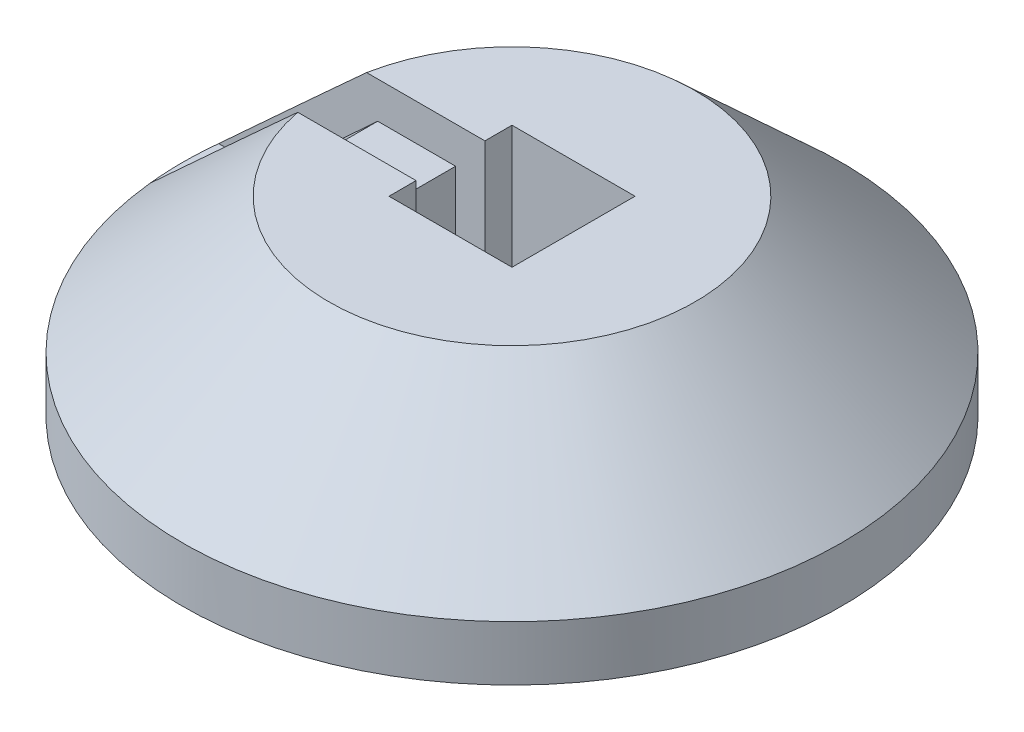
ISO-10303-21;
HEADER;
FILE_DESCRIPTION(('STEP AP214'),'2;1');
FILE_NAME('part.step','',(''),(''),'','','');
FILE_SCHEMA(('AUTOMOTIVE_DESIGN { 1 0 10303 214 1 1 1 1 }'));
ENDSEC;
DATA;
#1=APPLICATION_CONTEXT('core data for automotive mechanical design processes');
#2=APPLICATION_PROTOCOL_DEFINITION('international standard','automotive_design',2000,#1);
#3=PRODUCT_CONTEXT('',#1,'mechanical');
#4=PRODUCT('Part','Part','',(#3));
#5=PRODUCT_RELATED_PRODUCT_CATEGORY('part','',(#4));
#6=PRODUCT_DEFINITION_FORMATION('','',#4);
#7=PRODUCT_DEFINITION_CONTEXT('part definition',#1,'design');
#8=PRODUCT_DEFINITION('design','',#6,#7);
#9=PRODUCT_DEFINITION_SHAPE('','',#8);
#10=(LENGTH_UNIT() NAMED_UNIT(*) SI_UNIT(.MILLI.,.METRE.));
#11=(NAMED_UNIT(*) PLANE_ANGLE_UNIT() SI_UNIT($,.RADIAN.));
#12=(NAMED_UNIT(*) SI_UNIT($,.STERADIAN.) SOLID_ANGLE_UNIT());
#13=UNCERTAINTY_MEASURE_WITH_UNIT(LENGTH_MEASURE(1.E-05),#10,'distance_accuracy_value','');
#14=(GEOMETRIC_REPRESENTATION_CONTEXT(3) GLOBAL_UNCERTAINTY_ASSIGNED_CONTEXT((#13)) GLOBAL_UNIT_ASSIGNED_CONTEXT((#10,
#11,#12)) REPRESENTATION_CONTEXT('',''));
#15=CARTESIAN_POINT('',(0.,0.,0.));
#16=DIRECTION('',(0.,0.,1.));
#17=DIRECTION('',(1.,0.,0.));
#18=AXIS2_PLACEMENT_3D('',#15,#16,#17);
#19=CARTESIAN_POINT('',(0.,66.04,0.));
#20=DIRECTION('',(0.,-1.,0.));
#21=DIRECTION('',(1.,0.,0.));
#22=AXIS2_PLACEMENT_3D('',#19,#20,#21);
#23=CONICAL_SURFACE('',#22,63.5,0.824339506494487);
#24=CARTESIAN_POINT('',(0.,66.04,0.));
#25=DIRECTION('',(0.,1.,0.));
#26=DIRECTION('',(-1.,0.,0.));
#27=AXIS2_PLACEMENT_3D('',#24,#25,#26);
#28=CIRCLE('',#27,63.5);
#29=CARTESIAN_POINT('',(-62.367733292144,66.04,11.938));
#30=VERTEX_POINT('',#29);
#31=CARTESIAN_POINT('',(-62.367733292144,66.04,-11.938));
#32=VERTEX_POINT('',#31);
#33=EDGE_CURVE('E79',#30,#32,#28,.T.);
#34=ORIENTED_EDGE('',*,*,#33,.F.);
#35=CARTESIAN_POINT('',(0.000699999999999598,113.734849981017,11.938));
#36=CARTESIAN_POINT('',(-0.196541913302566,113.734884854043,11.938));
#37=CARTESIAN_POINT('',(-0.393775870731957,113.730350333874,11.938));
#38=CARTESIAN_POINT('',(-0.787801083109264,113.712322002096,11.938));
#39=CARTESIAN_POINT('',(-0.984592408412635,113.698829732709,11.938));
#40=CARTESIAN_POINT('',(-1.37695571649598,113.663103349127,11.938));
#41=CARTESIAN_POINT('',(-1.57252940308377,113.64088790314,11.938));
#42=CARTESIAN_POINT('',(-1.96253114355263,113.588052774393,11.938));
#43=CARTESIAN_POINT('',(-2.15695915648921,113.557432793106,11.938));
#44=CARTESIAN_POINT('',(-2.73003495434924,113.455010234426,11.938));
#45=CARTESIAN_POINT('',(-3.1066976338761,113.371859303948,11.938));
#46=CARTESIAN_POINT('',(-3.85310817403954,113.178662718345,11.938));
#47=CARTESIAN_POINT('',(-4.22285250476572,113.068603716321,11.938));
#48=CARTESIAN_POINT('',(-5.02037718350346,112.803923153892,11.938));
#49=CARTESIAN_POINT('',(-5.44667133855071,112.64484939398,11.938));
#50=CARTESIAN_POINT('',(-6.2889347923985,112.301189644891,11.938));
#51=CARTESIAN_POINT('',(-6.7048991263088,112.116591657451,11.938));
#52=CARTESIAN_POINT('',(-7.52786809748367,111.726818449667,11.938));
#53=CARTESIAN_POINT('',(-7.93485615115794,111.521608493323,11.938));
#54=CARTESIAN_POINT('',(-8.74016838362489,111.095081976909,11.938));
#55=CARTESIAN_POINT('',(-9.1384937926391,110.873767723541,11.938));
#56=CARTESIAN_POINT('',(-9.93540910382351,110.413784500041,11.938));
#57=CARTESIAN_POINT('',(-10.3338509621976,110.174860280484,11.938));
#58=CARTESIAN_POINT('',(-11.1240728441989,109.686258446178,11.938));
#59=CARTESIAN_POINT('',(-11.515852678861,109.436580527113,11.938));
#60=CARTESIAN_POINT('',(-12.2932869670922,108.92878963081,11.938));
#61=CARTESIAN_POINT('',(-12.6789476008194,108.670686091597,11.938));
#62=CARTESIAN_POINT('',(-13.2537711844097,108.278195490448,11.938));
#63=CARTESIAN_POINT('',(-13.4447654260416,108.146477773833,11.938));
#64=CARTESIAN_POINT('',(-13.8256238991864,107.881418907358,11.938));
#65=CARTESIAN_POINT('',(-14.0154881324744,107.74807776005,11.938));
#66=CARTESIAN_POINT('',(-14.6257731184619,107.315919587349,11.938));
#67=CARTESIAN_POINT('',(-15.0441378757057,107.014196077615,11.938));
#68=CARTESIAN_POINT('',(-15.8765077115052,106.404785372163,11.938));
#69=CARTESIAN_POINT('',(-16.2905126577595,106.097097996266,11.938));
#70=CARTESIAN_POINT('',(-17.1148437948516,105.476753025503,11.938));
#71=CARTESIAN_POINT('',(-17.5251696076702,105.164094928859,11.938));
#72=CARTESIAN_POINT('',(-18.3426387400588,104.534641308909,11.938));
#73=CARTESIAN_POINT('',(-18.7497820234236,104.217845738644,11.938));
#74=CARTESIAN_POINT('',(-19.5614915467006,103.580631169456,11.938));
#75=CARTESIAN_POINT('',(-19.9660566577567,103.260210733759,11.938));
#76=CARTESIAN_POINT('',(-20.7728076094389,102.616386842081,11.938));
#77=CARTESIAN_POINT('',(-21.1749934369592,102.292983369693,11.938));
#78=CARTESIAN_POINT('',(-22.378406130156,101.318990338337,11.938));
#79=CARTESIAN_POINT('',(-23.1765394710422,100.664577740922,11.938));
#80=CARTESIAN_POINT('',(-24.7676477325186,99.3471212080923,11.938));
#81=CARTESIAN_POINT('',(-25.5606131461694,98.6840658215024,11.938));
#82=CARTESIAN_POINT('',(-27.141552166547,97.352016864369,11.938));
#83=CARTESIAN_POINT('',(-27.9295257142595,96.6830232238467,11.938));
#84=CARTESIAN_POINT('',(-29.5012913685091,95.3405302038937,11.938));
#85=CARTESIAN_POINT('',(-30.2850844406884,94.6670319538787,11.938));
#86=CARTESIAN_POINT('',(-31.849435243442,93.3162971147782,11.938));
#87=CARTESIAN_POINT('',(-32.6299929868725,92.6390605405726,11.938));
#88=CARTESIAN_POINT('',(-34.180118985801,91.2888065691,11.938));
#89=CARTESIAN_POINT('',(-34.9497154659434,90.6158215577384,11.938));
#90=CARTESIAN_POINT('',(-36.4867461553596,89.2673861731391,11.938));
#91=CARTESIAN_POINT('',(-37.2541803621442,88.5919357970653,11.938));
#92=CARTESIAN_POINT('',(-39.5538627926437,86.5624375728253,11.938));
#93=CARTESIAN_POINT('',(-41.0834020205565,85.2053201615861,11.938));
#94=CARTESIAN_POINT('',(-44.1360317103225,82.4863161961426,11.938));
#95=CARTESIAN_POINT('',(-45.6591263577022,81.1244343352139,11.938));
#96=CARTESIAN_POINT('',(-48.7013737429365,78.3963315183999,11.938));
#97=CARTESIAN_POINT('',(-50.2205265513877,77.0301106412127,11.938));
#98=CARTESIAN_POINT('',(-53.0288597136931,74.4989054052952,11.938));
#99=CARTESIAN_POINT('',(-54.318455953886,73.3343822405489,11.938));
#100=CARTESIAN_POINT('',(-56.8958772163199,71.0033771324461,11.938));
#101=CARTESIAN_POINT('',(-58.1837022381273,69.8368951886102,11.938));
#102=CARTESIAN_POINT('',(-62.0450255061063,66.3350442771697,11.938));
#103=CARTESIAN_POINT('',(-64.616355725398,63.997284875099,11.938));
#104=CARTESIAN_POINT('',(-69.7557878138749,59.3166093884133,11.938));
#105=CARTESIAN_POINT('',(-72.3238884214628,56.9736919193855,11.938));
#106=CARTESIAN_POINT('',(-77.4571374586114,52.2846364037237,11.938));
#107=CARTESIAN_POINT('',(-80.0222858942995,49.9384983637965,11.938));
#108=CARTESIAN_POINT('',(-85.1808599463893,45.215899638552,11.938));
#109=CARTESIAN_POINT('',(-87.7742591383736,42.8394100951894,11.938));
#110=CARTESIAN_POINT('',(-92.9593226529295,38.0845356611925,11.938));
#111=CARTESIAN_POINT('',(-95.5509869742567,35.7061507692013,11.938));
#112=CARTESIAN_POINT('',(-100.732098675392,30.9486923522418,11.938));
#113=CARTESIAN_POINT('',(-103.321546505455,28.5696193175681,11.938));
#114=CARTESIAN_POINT('',(-108.499343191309,23.8102823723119,11.938));
#115=CARTESIAN_POINT('',(-111.087692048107,21.4300184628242,11.938));
#116=CARTESIAN_POINT('',(-113.67562250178,19.0493,11.938));
#117=B_SPLINE_CURVE_WITH_KNOTS('',3,(#35,#36,#37,#38,#39,#40,#41,#42,#43,#44,#45,#46,#47,#48,
#49,#50,#51,#52,#53,#54,#55,#56,#57,#58,#59,#60,#61,#62,#63,#64,#65,#66,#67,#68,#69,#70,#71,#72,
#73,#74,#75,#76,#77,#78,#79,#80,#81,#82,#83,#84,#85,#86,#87,#88,#89,#90,#91,#92,#93,#94,#95,#96,
#97,#98,#99,#100,#101,#102,#103,#104,#105,#106,#107,#108,#109,#110,#111,#112,#113,#114,#115,
#116),.UNSPECIFIED.,.F.,.F.,(4,2,2,2,2,2,2,2,2,2,2,2,2,2,2,2,2,2,2,2,2,2,2,2,2,2,2,2,2,2,2,2,2,
2,2,2,2,2,2,2,4),(0.,0.591659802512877,1.18321776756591,1.7735165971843,2.36383639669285,
3.51977225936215,4.67628265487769,6.04023799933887,7.40483669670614,8.77177492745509,
10.1385177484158,11.532067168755,12.9256560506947,14.3177341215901,15.0137555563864,
15.7097758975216,17.2571516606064,18.8045742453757,20.3521540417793,21.8997514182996,
23.44798534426,24.9962277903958,28.092516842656,31.1934394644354,34.2943986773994,
37.3946075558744,40.4948041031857,43.5618302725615,46.6288599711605,52.7632730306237,
58.8927702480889,65.0221569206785,70.2348846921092,75.4476137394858,85.873137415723,
96.301922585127,106.730686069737,117.283447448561,127.83621638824,138.385484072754,
148.934742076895),.UNSPECIFIED.);
#118=CARTESIAN_POINT('',(-113.674861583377,19.05,11.938));
#119=VERTEX_POINT('',#118);
#120=EDGE_CURVE('E197',#30,#119,#117,.T.);
#121=ORIENTED_EDGE('',*,*,#120,.T.);
#122=CARTESIAN_POINT('',(0.,19.05,0.));
#123=DIRECTION('',(0.,1.,0.));
#124=DIRECTION('',(-1.,0.,0.));
#125=AXIS2_PLACEMENT_3D('',#122,#123,#124);
#126=CIRCLE('',#125,114.3);
#127=CARTESIAN_POINT('',(-113.674861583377,19.05,-11.938));
#128=VERTEX_POINT('',#127);
#129=EDGE_CURVE('E215',#119,#128,#126,.T.);
#130=ORIENTED_EDGE('',*,*,#129,.T.);
#131=CARTESIAN_POINT('',(0.000699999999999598,113.734849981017,-11.938));
#132=CARTESIAN_POINT('',(-0.196541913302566,113.734884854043,-11.938));
#133=CARTESIAN_POINT('',(-0.393775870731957,113.730350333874,-11.938));
#134=CARTESIAN_POINT('',(-0.787801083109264,113.712322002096,-11.938));
#135=CARTESIAN_POINT('',(-0.984592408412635,113.698829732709,-11.938));
#136=CARTESIAN_POINT('',(-1.37695571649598,113.663103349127,-11.938));
#137=CARTESIAN_POINT('',(-1.57252940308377,113.64088790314,-11.938));
#138=CARTESIAN_POINT('',(-1.96253114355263,113.588052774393,-11.938));
#139=CARTESIAN_POINT('',(-2.15695915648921,113.557432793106,-11.938));
#140=CARTESIAN_POINT('',(-2.73003495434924,113.455010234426,-11.938));
#141=CARTESIAN_POINT('',(-3.1066976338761,113.371859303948,-11.938));
#142=CARTESIAN_POINT('',(-3.85310817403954,113.178662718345,-11.938));
#143=CARTESIAN_POINT('',(-4.22285250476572,113.068603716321,-11.938));
#144=CARTESIAN_POINT('',(-5.02037718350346,112.803923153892,-11.938));
#145=CARTESIAN_POINT('',(-5.44667133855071,112.64484939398,-11.938));
#146=CARTESIAN_POINT('',(-6.2889347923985,112.301189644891,-11.938));
#147=CARTESIAN_POINT('',(-6.7048991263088,112.116591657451,-11.938));
#148=CARTESIAN_POINT('',(-7.52786809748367,111.726818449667,-11.938));
#149=CARTESIAN_POINT('',(-7.93485615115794,111.521608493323,-11.938));
#150=CARTESIAN_POINT('',(-8.74016838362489,111.095081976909,-11.938));
#151=CARTESIAN_POINT('',(-9.1384937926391,110.873767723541,-11.938));
#152=CARTESIAN_POINT('',(-9.93540910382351,110.413784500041,-11.938));
#153=CARTESIAN_POINT('',(-10.3338509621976,110.174860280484,-11.938));
#154=CARTESIAN_POINT('',(-11.1240728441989,109.686258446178,-11.938));
#155=CARTESIAN_POINT('',(-11.515852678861,109.436580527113,-11.938));
#156=CARTESIAN_POINT('',(-12.2932869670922,108.92878963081,-11.938));
#157=CARTESIAN_POINT('',(-12.6789476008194,108.670686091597,-11.938));
#158=CARTESIAN_POINT('',(-13.2537711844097,108.278195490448,-11.938));
#159=CARTESIAN_POINT('',(-13.4447654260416,108.146477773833,-11.938));
#160=CARTESIAN_POINT('',(-13.8256238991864,107.881418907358,-11.938));
#161=CARTESIAN_POINT('',(-14.0154881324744,107.74807776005,-11.938));
#162=CARTESIAN_POINT('',(-14.6257731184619,107.315919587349,-11.938));
#163=CARTESIAN_POINT('',(-15.0441378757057,107.014196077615,-11.938));
#164=CARTESIAN_POINT('',(-15.8765077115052,106.404785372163,-11.938));
#165=CARTESIAN_POINT('',(-16.2905126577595,106.097097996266,-11.938));
#166=CARTESIAN_POINT('',(-17.1148437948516,105.476753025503,-11.938));
#167=CARTESIAN_POINT('',(-17.5251696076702,105.164094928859,-11.938));
#168=CARTESIAN_POINT('',(-18.3426387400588,104.534641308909,-11.938));
#169=CARTESIAN_POINT('',(-18.7497820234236,104.217845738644,-11.938));
#170=CARTESIAN_POINT('',(-19.5614915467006,103.580631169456,-11.938));
#171=CARTESIAN_POINT('',(-19.9660566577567,103.260210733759,-11.938));
#172=CARTESIAN_POINT('',(-20.7728076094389,102.616386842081,-11.938));
#173=CARTESIAN_POINT('',(-21.1749934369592,102.292983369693,-11.938));
#174=CARTESIAN_POINT('',(-22.378406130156,101.318990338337,-11.938));
#175=CARTESIAN_POINT('',(-23.1765394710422,100.664577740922,-11.938));
#176=CARTESIAN_POINT('',(-24.7676477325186,99.3471212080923,-11.938));
#177=CARTESIAN_POINT('',(-25.5606131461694,98.6840658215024,-11.938));
#178=CARTESIAN_POINT('',(-27.141552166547,97.352016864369,-11.938));
#179=CARTESIAN_POINT('',(-27.9295257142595,96.6830232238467,-11.938));
#180=CARTESIAN_POINT('',(-29.5012913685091,95.3405302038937,-11.938));
#181=CARTESIAN_POINT('',(-30.2850844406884,94.6670319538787,-11.938));
#182=CARTESIAN_POINT('',(-31.849435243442,93.3162971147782,-11.938));
#183=CARTESIAN_POINT('',(-32.6299929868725,92.6390605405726,-11.938));
#184=CARTESIAN_POINT('',(-34.180118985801,91.2888065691,-11.938));
#185=CARTESIAN_POINT('',(-34.9497154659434,90.6158215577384,-11.938));
#186=CARTESIAN_POINT('',(-36.4867461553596,89.2673861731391,-11.938));
#187=CARTESIAN_POINT('',(-37.2541803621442,88.5919357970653,-11.938));
#188=CARTESIAN_POINT('',(-39.5538627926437,86.5624375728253,-11.938));
#189=CARTESIAN_POINT('',(-41.0834020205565,85.2053201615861,-11.938));
#190=CARTESIAN_POINT('',(-44.1360317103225,82.4863161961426,-11.938));
#191=CARTESIAN_POINT('',(-45.6591263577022,81.1244343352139,-11.938));
#192=CARTESIAN_POINT('',(-48.7013737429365,78.3963315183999,-11.938));
#193=CARTESIAN_POINT('',(-50.2205265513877,77.0301106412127,-11.938));
#194=CARTESIAN_POINT('',(-53.0288597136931,74.4989054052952,-11.938));
#195=CARTESIAN_POINT('',(-54.318455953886,73.3343822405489,-11.938));
#196=CARTESIAN_POINT('',(-56.8958772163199,71.0033771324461,-11.938));
#197=CARTESIAN_POINT('',(-58.1837022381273,69.8368951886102,-11.938));
#198=CARTESIAN_POINT('',(-62.0450255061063,66.3350442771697,-11.938));
#199=CARTESIAN_POINT('',(-64.616355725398,63.997284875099,-11.938));
#200=CARTESIAN_POINT('',(-69.7557878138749,59.3166093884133,-11.938));
#201=CARTESIAN_POINT('',(-72.3238884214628,56.9736919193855,-11.938));
#202=CARTESIAN_POINT('',(-77.4571374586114,52.2846364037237,-11.938));
#203=CARTESIAN_POINT('',(-80.0222858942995,49.9384983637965,-11.938));
#204=CARTESIAN_POINT('',(-85.1808599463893,45.215899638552,-11.938));
#205=CARTESIAN_POINT('',(-87.7742591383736,42.8394100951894,-11.938));
#206=CARTESIAN_POINT('',(-92.9593226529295,38.0845356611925,-11.938));
#207=CARTESIAN_POINT('',(-95.5509869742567,35.7061507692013,-11.938));
#208=CARTESIAN_POINT('',(-100.732098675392,30.9486923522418,-11.938));
#209=CARTESIAN_POINT('',(-103.321546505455,28.5696193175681,-11.938));
#210=CARTESIAN_POINT('',(-108.499343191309,23.8102823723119,-11.938));
#211=CARTESIAN_POINT('',(-111.087692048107,21.4300184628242,-11.938));
#212=CARTESIAN_POINT('',(-113.67562250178,19.0493,-11.938));
#213=B_SPLINE_CURVE_WITH_KNOTS('',3,(#131,#132,#133,#134,#135,#136,#137,#138,#139,#140,#141,
#142,#143,#144,#145,#146,#147,#148,#149,#150,#151,#152,#153,#154,#155,#156,#157,#158,#159,#160,
#161,#162,#163,#164,#165,#166,#167,#168,#169,#170,#171,#172,#173,#174,#175,#176,#177,#178,#179,
#180,#181,#182,#183,#184,#185,#186,#187,#188,#189,#190,#191,#192,#193,#194,#195,#196,#197,#198,
#199,#200,#201,#202,#203,#204,#205,#206,#207,#208,#209,#210,#211,#212),.UNSPECIFIED.,.F.,.F.,(4,
2,2,2,2,2,2,2,2,2,2,2,2,2,2,2,2,2,2,2,2,2,2,2,2,2,2,2,2,2,2,2,2,2,2,2,2,2,2,2,4),(0.,
0.591659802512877,1.18321776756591,1.7735165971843,2.36383639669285,3.51977225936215,
4.67628265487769,6.04023799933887,7.40483669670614,8.77177492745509,10.1385177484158,
11.532067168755,12.9256560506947,14.3177341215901,15.0137555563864,15.7097758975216,
17.2571516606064,18.8045742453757,20.3521540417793,21.8997514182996,23.44798534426,
24.9962277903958,28.092516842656,31.1934394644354,34.2943986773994,37.3946075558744,
40.4948041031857,43.5618302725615,46.6288599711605,52.7632730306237,58.8927702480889,
65.0221569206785,70.2348846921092,75.4476137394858,85.873137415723,96.301922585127,
106.730686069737,117.283447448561,127.83621638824,138.385484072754,148.934742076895),.UNSPECIFIED.);
#214=EDGE_CURVE('E302',#32,#128,#213,.T.);
#215=ORIENTED_EDGE('',*,*,#214,.F.);
#216=EDGE_LOOP('',(#34,#121,#130,#215));
#217=FACE_BOUND('',#216,.T.);
#218=ADVANCED_FACE('F67',(#217),#23,.T.);
#219=CARTESIAN_POINT('',(-31.496,6.09599999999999,11.938));
#220=DIRECTION('',(1.,0.,0.));
#221=DIRECTION('',(0.,1.,0.));
#222=AXIS2_PLACEMENT_3D('',#219,#220,#221);
#223=PLANE('',#222);
#224=DIRECTION('',(0.,1.,0.));
#225=VECTOR('',#224,1.);
#226=CARTESIAN_POINT('',(-31.496,6.09599999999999,-11.938));
#227=LINE('',#226,#225);
#228=CARTESIAN_POINT('',(-31.496,6.09599999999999,-11.938));
#229=VERTEX_POINT('',#228);
#230=CARTESIAN_POINT('',(-31.496,53.34,-11.938));
#231=VERTEX_POINT('',#230);
#232=EDGE_CURVE('E194',#229,#231,#227,.T.);
#233=ORIENTED_EDGE('',*,*,#232,.T.);
#234=DIRECTION('',(0.,0.,1.));
#235=VECTOR('',#234,1.);
#236=CARTESIAN_POINT('',(-31.496,53.34,11.938));
#237=LINE('',#236,#235);
#238=CARTESIAN_POINT('',(-31.496,53.34,11.938));
#239=VERTEX_POINT('',#238);
#240=EDGE_CURVE('E12',#231,#239,#237,.T.);
#241=ORIENTED_EDGE('',*,*,#240,.T.);
#242=DIRECTION('',(0.,1.,0.));
#243=VECTOR('',#242,1.);
#244=CARTESIAN_POINT('',(-31.496,6.09599999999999,11.938));
#245=LINE('',#244,#243);
#246=CARTESIAN_POINT('',(-31.496,6.09599999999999,11.938));
#247=VERTEX_POINT('',#246);
#248=EDGE_CURVE('E107',#247,#239,#245,.T.);
#249=ORIENTED_EDGE('',*,*,#248,.F.);
#250=DIRECTION('',(0.,0.,-1.));
#251=VECTOR('',#250,1.);
#252=CARTESIAN_POINT('',(-31.496,6.09599999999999,11.938));
#253=LINE('',#252,#251);
#254=EDGE_CURVE('E195',#247,#229,#253,.T.);
#255=ORIENTED_EDGE('',*,*,#254,.T.);
#256=EDGE_LOOP('',(#233,#241,#249,#255));
#257=FACE_BOUND('',#256,.T.);
#258=ADVANCED_FACE('F353',(#257),#223,.T.);
#259=CARTESIAN_POINT('',(0.,66.04,0.));
#260=DIRECTION('',(0.,1.,0.));
#261=DIRECTION('',(-1.,0.,0.));
#262=AXIS2_PLACEMENT_3D('',#259,#260,#261);
#263=PLANE('',#262);
#264=ORIENTED_EDGE('',*,*,#33,.T.);
#265=DIRECTION('',(1.,0.,0.));
#266=VECTOR('',#265,1.);
#267=CARTESIAN_POINT('',(-31.496,66.04,-11.938));
#268=LINE('',#267,#266);
#269=CARTESIAN_POINT('',(-21.336,66.04,-11.938));
#270=VERTEX_POINT('',#269);
#271=EDGE_CURVE('E137',#32,#270,#268,.T.);
#272=ORIENTED_EDGE('',*,*,#271,.T.);
#273=DIRECTION('',(0.,0.,-1.));
#274=VECTOR('',#273,1.);
#275=CARTESIAN_POINT('',(-21.336,66.04,0.));
#276=LINE('',#275,#274);
#277=CARTESIAN_POINT('',(-21.336,66.04,-21.336));
#278=VERTEX_POINT('',#277);
#279=EDGE_CURVE('E143',#270,#278,#276,.T.);
#280=ORIENTED_EDGE('',*,*,#279,.T.);
#281=DIRECTION('',(1.,0.,0.));
#282=VECTOR('',#281,1.);
#283=CARTESIAN_POINT('',(0.,66.04,-21.336));
#284=LINE('',#283,#282);
#285=CARTESIAN_POINT('',(21.336,66.04,-21.336));
#286=VERTEX_POINT('',#285);
#287=EDGE_CURVE('E170',#278,#286,#284,.T.);
#288=ORIENTED_EDGE('',*,*,#287,.T.);
#289=DIRECTION('',(0.,0.,-1.));
#290=VECTOR('',#289,1.);
#291=CARTESIAN_POINT('',(21.336,66.04,0.));
#292=LINE('',#291,#290);
#293=CARTESIAN_POINT('',(21.336,66.04,21.336));
#294=VERTEX_POINT('',#293);
#295=EDGE_CURVE('E174',#294,#286,#292,.T.);
#296=ORIENTED_EDGE('',*,*,#295,.F.);
#297=DIRECTION('',(1.,0.,0.));
#298=VECTOR('',#297,1.);
#299=CARTESIAN_POINT('',(0.,66.04,21.336));
#300=LINE('',#299,#298);
#301=CARTESIAN_POINT('',(-21.336,66.04,21.336));
#302=VERTEX_POINT('',#301);
#303=EDGE_CURVE('E203',#302,#294,#300,.T.);
#304=ORIENTED_EDGE('',*,*,#303,.F.);
#305=CARTESIAN_POINT('',(-21.336,66.04,11.938));
#306=VERTEX_POINT('',#305);
#307=EDGE_CURVE('E167',#302,#306,#276,.T.);
#308=ORIENTED_EDGE('',*,*,#307,.T.);
#309=DIRECTION('',(1.,0.,0.));
#310=VECTOR('',#309,1.);
#311=CARTESIAN_POINT('',(-31.496,66.04,11.938));
#312=LINE('',#311,#310);
#313=EDGE_CURVE('E147',#30,#306,#312,.T.);
#314=ORIENTED_EDGE('',*,*,#313,.F.);
#315=EDGE_LOOP('',(#264,#272,#280,#288,#296,#304,#308,#314));
#316=FACE_BOUND('',#315,.T.);
#317=ADVANCED_FACE('F72',(#316),#263,.T.);
#318=CARTESIAN_POINT('',(0.,66.04,0.));
#319=DIRECTION('',(0.,1.,0.));
#320=DIRECTION('',(-1.,0.,0.));
#321=AXIS2_PLACEMENT_3D('',#318,#319,#320);
#322=CYLINDRICAL_SURFACE('',#321,114.3);
#323=CARTESIAN_POINT('',(0.,0.,0.));
#324=DIRECTION('',(0.,1.,0.));
#325=DIRECTION('',(-1.,0.,0.));
#326=AXIS2_PLACEMENT_3D('',#323,#324,#325);
#327=CIRCLE('',#326,114.3);
#328=CARTESIAN_POINT('',(-114.3,0.,0.));
#329=VERTEX_POINT('',#328);
#330=EDGE_CURVE('E208',#329,#329,#327,.T.);
#331=ORIENTED_EDGE('',*,*,#330,.T.);
#332=EDGE_LOOP('',(#331));
#333=FACE_BOUND('',#332,.T.);
#334=EDGE_CURVE('E213',#128,#119,#126,.T.);
#335=ORIENTED_EDGE('',*,*,#334,.F.);
#336=ORIENTED_EDGE('',*,*,#129,.F.);
#337=EDGE_LOOP('',(#335,#336));
#338=FACE_BOUND('',#337,.T.);
#339=ADVANCED_FACE('F362',(#333,#338),#322,.T.);
#340=CARTESIAN_POINT('',(-63.5,0.,0.));
#341=DIRECTION('',(0.,-1.,0.));
#342=DIRECTION('',(1.,0.,0.));
#343=AXIS2_PLACEMENT_3D('',#340,#341,#342);
#344=PLANE('',#343);
#345=ORIENTED_EDGE('',*,*,#330,.F.);
#346=EDGE_LOOP('',(#345));
#347=FACE_BOUND('',#346,.T.);
#348=ADVANCED_FACE('F348',(#347),#344,.T.);
#349=CARTESIAN_POINT('',(21.336,6.09599999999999,0.));
#350=DIRECTION('',(1.,0.,0.));
#351=DIRECTION('',(0.,1.,0.));
#352=AXIS2_PLACEMENT_3D('',#349,#350,#351);
#353=PLANE('',#352);
#354=ORIENTED_EDGE('',*,*,#295,.T.);
#355=DIRECTION('',(0.,1.,0.));
#356=VECTOR('',#355,1.);
#357=CARTESIAN_POINT('',(21.336,6.09599999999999,-21.336));
#358=LINE('',#357,#356);
#359=CARTESIAN_POINT('',(21.336,6.09599999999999,-21.336));
#360=VERTEX_POINT('',#359);
#361=EDGE_CURVE('E182',#360,#286,#358,.T.);
#362=ORIENTED_EDGE('',*,*,#361,.F.);
#363=DIRECTION('',(0.,0.,-1.));
#364=VECTOR('',#363,1.);
#365=CARTESIAN_POINT('',(21.336,6.09599999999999,0.));
#366=LINE('',#365,#364);
#367=CARTESIAN_POINT('',(21.336,6.09599999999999,21.336));
#368=VERTEX_POINT('',#367);
#369=EDGE_CURVE('E229',#368,#360,#366,.T.);
#370=ORIENTED_EDGE('',*,*,#369,.F.);
#371=DIRECTION('',(0.,1.,0.));
#372=VECTOR('',#371,1.);
#373=CARTESIAN_POINT('',(21.336,6.09599999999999,21.336));
#374=LINE('',#373,#372);
#375=EDGE_CURVE('E117',#368,#294,#374,.T.);
#376=ORIENTED_EDGE('',*,*,#375,.T.);
#377=EDGE_LOOP('',(#354,#362,#370,#376));
#378=FACE_BOUND('',#377,.T.);
#379=ADVANCED_FACE('F249',(#378),#353,.F.);
#380=CARTESIAN_POINT('',(0.,6.09599999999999,21.336));
#381=DIRECTION('',(0.,0.,1.));
#382=DIRECTION('',(1.,0.,0.));
#383=AXIS2_PLACEMENT_3D('',#380,#381,#382);
#384=PLANE('',#383);
#385=ORIENTED_EDGE('',*,*,#303,.T.);
#386=ORIENTED_EDGE('',*,*,#375,.F.);
#387=DIRECTION('',(1.,0.,0.));
#388=VECTOR('',#387,1.);
#389=CARTESIAN_POINT('',(0.,6.09599999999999,21.336));
#390=LINE('',#389,#388);
#391=CARTESIAN_POINT('',(-21.336,6.09599999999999,21.336));
#392=VERTEX_POINT('',#391);
#393=EDGE_CURVE('E172',#392,#368,#390,.T.);
#394=ORIENTED_EDGE('',*,*,#393,.F.);
#395=DIRECTION('',(0.,1.,0.));
#396=VECTOR('',#395,1.);
#397=CARTESIAN_POINT('',(-21.336,6.09599999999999,21.336));
#398=LINE('',#397,#396);
#399=EDGE_CURVE('E157',#392,#302,#398,.T.);
#400=ORIENTED_EDGE('',*,*,#399,.T.);
#401=EDGE_LOOP('',(#385,#386,#394,#400));
#402=FACE_BOUND('',#401,.T.);
#403=ADVANCED_FACE('F350',(#402),#384,.F.);
#404=CARTESIAN_POINT('',(0.,6.09599999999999,-21.336));
#405=DIRECTION('',(0.,0.,1.));
#406=DIRECTION('',(1.,0.,0.));
#407=AXIS2_PLACEMENT_3D('',#404,#405,#406);
#408=PLANE('',#407);
#409=ORIENTED_EDGE('',*,*,#287,.F.);
#410=DIRECTION('',(0.,1.,0.));
#411=VECTOR('',#410,1.);
#412=CARTESIAN_POINT('',(-21.336,6.09599999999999,-21.336));
#413=LINE('',#412,#411);
#414=CARTESIAN_POINT('',(-21.336,6.09599999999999,-21.336));
#415=VERTEX_POINT('',#414);
#416=EDGE_CURVE('E162',#415,#278,#413,.T.);
#417=ORIENTED_EDGE('',*,*,#416,.F.);
#418=DIRECTION('',(1.,0.,0.));
#419=VECTOR('',#418,1.);
#420=CARTESIAN_POINT('',(0.,6.09599999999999,-21.336));
#421=LINE('',#420,#419);
#422=EDGE_CURVE('E223',#415,#360,#421,.T.);
#423=ORIENTED_EDGE('',*,*,#422,.T.);
#424=ORIENTED_EDGE('',*,*,#361,.T.);
#425=EDGE_LOOP('',(#409,#417,#423,#424));
#426=FACE_BOUND('',#425,.T.);
#427=ADVANCED_FACE('F255',(#426),#408,.T.);
#428=CARTESIAN_POINT('',(0.,6.09599999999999,0.));
#429=DIRECTION('',(0.,1.,0.));
#430=DIRECTION('',(0.,0.,1.));
#431=AXIS2_PLACEMENT_3D('',#428,#429,#430);
#432=PLANE('',#431);
#433=ORIENTED_EDGE('',*,*,#393,.T.);
#434=ORIENTED_EDGE('',*,*,#369,.T.);
#435=ORIENTED_EDGE('',*,*,#422,.F.);
#436=DIRECTION('',(0.,0.,-1.));
#437=VECTOR('',#436,1.);
#438=CARTESIAN_POINT('',(-21.336,6.09599999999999,0.));
#439=LINE('',#438,#437);
#440=CARTESIAN_POINT('',(-21.336,6.09599999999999,-11.938));
#441=VERTEX_POINT('',#440);
#442=EDGE_CURVE('E225',#441,#415,#439,.T.);
#443=ORIENTED_EDGE('',*,*,#442,.F.);
#444=DIRECTION('',(1.,0.,0.));
#445=VECTOR('',#444,1.);
#446=CARTESIAN_POINT('',(-31.496,6.09599999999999,-11.938));
#447=LINE('',#446,#445);
#448=EDGE_CURVE('E154',#229,#441,#447,.T.);
#449=ORIENTED_EDGE('',*,*,#448,.F.);
#450=ORIENTED_EDGE('',*,*,#254,.F.);
#451=DIRECTION('',(1.,0.,0.));
#452=VECTOR('',#451,1.);
#453=CARTESIAN_POINT('',(-31.496,6.09599999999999,11.938));
#454=LINE('',#453,#452);
#455=CARTESIAN_POINT('',(-21.336,6.09599999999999,11.938));
#456=VERTEX_POINT('',#455);
#457=EDGE_CURVE('E149',#247,#456,#454,.T.);
#458=ORIENTED_EDGE('',*,*,#457,.T.);
#459=EDGE_CURVE('E186',#392,#456,#439,.T.);
#460=ORIENTED_EDGE('',*,*,#459,.F.);
#461=EDGE_LOOP('',(#433,#434,#435,#443,#449,#450,#458,#460));
#462=FACE_BOUND('',#461,.T.);
#463=ADVANCED_FACE('F256',(#462),#432,.T.);
#464=CARTESIAN_POINT('',(-21.336,6.09599999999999,0.));
#465=DIRECTION('',(1.,0.,0.));
#466=DIRECTION('',(0.,1.,0.));
#467=AXIS2_PLACEMENT_3D('',#464,#465,#466);
#468=PLANE('',#467);
#469=ORIENTED_EDGE('',*,*,#442,.T.);
#470=ORIENTED_EDGE('',*,*,#416,.T.);
#471=ORIENTED_EDGE('',*,*,#279,.F.);
#472=DIRECTION('',(0.,1.,0.));
#473=VECTOR('',#472,1.);
#474=CARTESIAN_POINT('',(-21.336,6.09599999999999,-11.938));
#475=LINE('',#474,#473);
#476=EDGE_CURVE('E91',#441,#270,#475,.T.);
#477=ORIENTED_EDGE('',*,*,#476,.F.);
#478=EDGE_LOOP('',(#469,#470,#471,#477));
#479=FACE_BOUND('',#478,.T.);
#480=ADVANCED_FACE('F161',(#479),#468,.T.);
#481=DIRECTION('',(0.,1.,0.));
#482=VECTOR('',#481,1.);
#483=CARTESIAN_POINT('',(-21.336,6.09599999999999,11.938));
#484=LINE('',#483,#482);
#485=EDGE_CURVE('E158',#456,#306,#484,.T.);
#486=ORIENTED_EDGE('',*,*,#485,.T.);
#487=ORIENTED_EDGE('',*,*,#307,.F.);
#488=ORIENTED_EDGE('',*,*,#399,.F.);
#489=ORIENTED_EDGE('',*,*,#459,.T.);
#490=EDGE_LOOP('',(#486,#487,#488,#489));
#491=FACE_BOUND('',#490,.T.);
#492=ADVANCED_FACE('F342',(#491),#468,.T.);
#493=CARTESIAN_POINT('',(-31.496,6.09599999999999,-11.938));
#494=DIRECTION('',(0.,0.,1.));
#495=DIRECTION('',(1.,0.,0.));
#496=AXIS2_PLACEMENT_3D('',#493,#494,#495);
#497=PLANE('',#496);
#498=ORIENTED_EDGE('',*,*,#476,.T.);
#499=ORIENTED_EDGE('',*,*,#271,.F.);
#500=ORIENTED_EDGE('',*,*,#214,.T.);
#501=DIRECTION('',(1.,0.,0.));
#502=VECTOR('',#501,1.);
#503=CARTESIAN_POINT('',(-114.3,19.05,-11.938));
#504=LINE('',#503,#502);
#505=CARTESIAN_POINT('',(-95.5971799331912,19.05,-11.938));
#506=VERTEX_POINT('',#505);
#507=EDGE_CURVE('E311',#128,#506,#504,.T.);
#508=ORIENTED_EDGE('',*,*,#507,.T.);
#509=DIRECTION('',(0.734099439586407,0.679041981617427,0.));
#510=VECTOR('',#509,1.);
#511=CARTESIAN_POINT('',(-58.526909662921,53.34,-11.938));
#512=LINE('',#511,#510);
#513=CARTESIAN_POINT('',(-58.526909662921,53.34,-11.938));
#514=VERTEX_POINT('',#513);
#515=EDGE_CURVE('E305',#506,#514,#512,.T.);
#516=ORIENTED_EDGE('',*,*,#515,.T.);
#517=DIRECTION('',(1.,0.,0.));
#518=VECTOR('',#517,1.);
#519=CARTESIAN_POINT('',(-26.416,53.34,-11.938));
#520=LINE('',#519,#518);
#521=EDGE_CURVE('E297',#514,#231,#520,.T.);
#522=ORIENTED_EDGE('',*,*,#521,.T.);
#523=ORIENTED_EDGE('',*,*,#232,.F.);
#524=ORIENTED_EDGE('',*,*,#448,.T.);
#525=EDGE_LOOP('',(#498,#499,#500,#508,#516,#522,#523,#524));
#526=FACE_BOUND('',#525,.T.);
#527=ADVANCED_FACE('F155',(#526),#497,.T.);
#528=CARTESIAN_POINT('',(-31.496,6.09599999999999,11.938));
#529=DIRECTION('',(0.,0.,1.));
#530=DIRECTION('',(1.,0.,0.));
#531=AXIS2_PLACEMENT_3D('',#528,#529,#530);
#532=PLANE('',#531);
#533=ORIENTED_EDGE('',*,*,#313,.T.);
#534=ORIENTED_EDGE('',*,*,#485,.F.);
#535=ORIENTED_EDGE('',*,*,#457,.F.);
#536=ORIENTED_EDGE('',*,*,#248,.T.);
#537=DIRECTION('',(1.,0.,0.));
#538=VECTOR('',#537,1.);
#539=CARTESIAN_POINT('',(-26.416,53.34,11.938));
#540=LINE('',#539,#538);
#541=CARTESIAN_POINT('',(-58.526909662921,53.34,11.938));
#542=VERTEX_POINT('',#541);
#543=EDGE_CURVE('E84',#542,#239,#540,.T.);
#544=ORIENTED_EDGE('',*,*,#543,.F.);
#545=DIRECTION('',(0.734099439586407,0.679041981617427,0.));
#546=VECTOR('',#545,1.);
#547=CARTESIAN_POINT('',(-58.526909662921,53.34,11.938));
#548=LINE('',#547,#546);
#549=CARTESIAN_POINT('',(-95.5971799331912,19.05,11.938));
#550=VERTEX_POINT('',#549);
#551=EDGE_CURVE('E296',#550,#542,#548,.T.);
#552=ORIENTED_EDGE('',*,*,#551,.F.);
#553=DIRECTION('',(1.,0.,0.));
#554=VECTOR('',#553,1.);
#555=CARTESIAN_POINT('',(-114.3,19.05,11.938));
#556=LINE('',#555,#554);
#557=EDGE_CURVE('E285',#119,#550,#556,.T.);
#558=ORIENTED_EDGE('',*,*,#557,.F.);
#559=ORIENTED_EDGE('',*,*,#120,.F.);
#560=EDGE_LOOP('',(#533,#534,#535,#536,#544,#552,#558,#559));
#561=FACE_BOUND('',#560,.T.);
#562=ADVANCED_FACE('F307',(#561),#532,.F.);
#563=CARTESIAN_POINT('',(-114.3,19.05,11.938));
#564=DIRECTION('',(0.,1.,0.));
#565=DIRECTION('',(-1.,0.,0.));
#566=AXIS2_PLACEMENT_3D('',#563,#564,#565);
#567=PLANE('',#566);
#568=ORIENTED_EDGE('',*,*,#334,.T.);
#569=ORIENTED_EDGE('',*,*,#557,.T.);
#570=DIRECTION('',(0.,0.,-1.));
#571=VECTOR('',#570,1.);
#572=CARTESIAN_POINT('',(-95.5971799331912,19.05,11.938));
#573=LINE('',#572,#571);
#574=EDGE_CURVE('E287',#550,#506,#573,.T.);
#575=ORIENTED_EDGE('',*,*,#574,.T.);
#576=ORIENTED_EDGE('',*,*,#507,.F.);
#577=EDGE_LOOP('',(#568,#569,#575,#576));
#578=FACE_BOUND('',#577,.T.);
#579=ADVANCED_FACE('F290',(#578),#567,.T.);
#580=CARTESIAN_POINT('',(-58.526909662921,53.34,11.938));
#581=DIRECTION('',(-0.679041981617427,0.734099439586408,0.));
#582=DIRECTION('',(-0.734099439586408,-0.679041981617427,0.));
#583=AXIS2_PLACEMENT_3D('',#580,#581,#582);
#584=PLANE('',#583);
#585=ORIENTED_EDGE('',*,*,#515,.F.);
#586=ORIENTED_EDGE('',*,*,#574,.F.);
#587=ORIENTED_EDGE('',*,*,#551,.T.);
#588=DIRECTION('',(0.,0.,-1.));
#589=VECTOR('',#588,1.);
#590=CARTESIAN_POINT('',(-58.526909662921,53.34,11.938));
#591=LINE('',#590,#589);
#592=EDGE_CURVE('E304',#542,#514,#591,.T.);
#593=ORIENTED_EDGE('',*,*,#592,.T.);
#594=EDGE_LOOP('',(#585,#586,#587,#593));
#595=FACE_BOUND('',#594,.T.);
#596=ADVANCED_FACE('F300',(#595),#584,.T.);
#597=CARTESIAN_POINT('',(-26.416,53.34,11.938));
#598=DIRECTION('',(0.,1.,0.));
#599=DIRECTION('',(0.,0.,1.));
#600=AXIS2_PLACEMENT_3D('',#597,#598,#599);
#601=PLANE('',#600);
#602=ORIENTED_EDGE('',*,*,#521,.F.);
#603=ORIENTED_EDGE('',*,*,#592,.F.);
#604=ORIENTED_EDGE('',*,*,#543,.T.);
#605=ORIENTED_EDGE('',*,*,#240,.F.);
#606=EDGE_LOOP('',(#602,#603,#604,#605));
#607=FACE_BOUND('',#606,.T.);
#608=ADVANCED_FACE('F334',(#607),#601,.T.);
#609=CLOSED_SHELL('',(#218,#258,#317,#339,#348,#379,#403,#427,#463,#480,#492,#527,#562,#579,
#596,#608));
#610=MANIFOLD_SOLID_BREP('B2',#609);
#611=ADVANCED_BREP_SHAPE_REPRESENTATION('',(#18,#610),#14);
#612=SHAPE_DEFINITION_REPRESENTATION(#9,#611);
ENDSEC;
END-ISO-10303-21;
